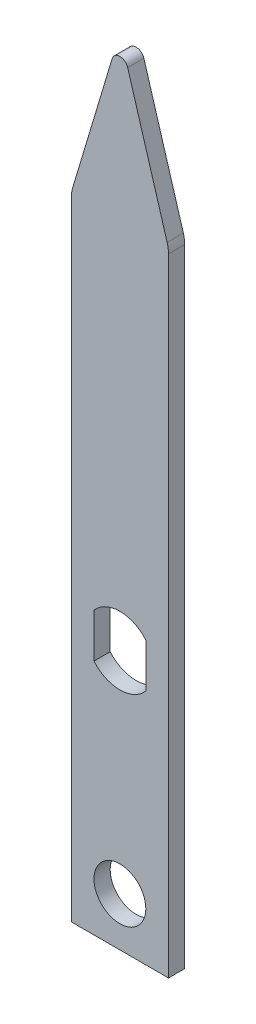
ISO-10303-21;
HEADER;
FILE_DESCRIPTION(('STEP AP214'),'2;1');
FILE_NAME('part.step','',(''),(''),'','','');
FILE_SCHEMA(('AUTOMOTIVE_DESIGN { 1 0 10303 214 1 1 1 1 }'));
ENDSEC;
DATA;
#1=APPLICATION_CONTEXT('core data for automotive mechanical design processes');
#2=APPLICATION_PROTOCOL_DEFINITION('international standard','automotive_design',2000,#1);
#3=PRODUCT_CONTEXT('',#1,'mechanical');
#4=PRODUCT('Part','Part','',(#3));
#5=PRODUCT_RELATED_PRODUCT_CATEGORY('part','',(#4));
#6=PRODUCT_DEFINITION_FORMATION('','',#4);
#7=PRODUCT_DEFINITION_CONTEXT('part definition',#1,'design');
#8=PRODUCT_DEFINITION('design','',#6,#7);
#9=PRODUCT_DEFINITION_SHAPE('','',#8);
#10=(LENGTH_UNIT() NAMED_UNIT(*) SI_UNIT(.MILLI.,.METRE.));
#11=(NAMED_UNIT(*) PLANE_ANGLE_UNIT() SI_UNIT($,.RADIAN.));
#12=(NAMED_UNIT(*) SI_UNIT($,.STERADIAN.) SOLID_ANGLE_UNIT());
#13=UNCERTAINTY_MEASURE_WITH_UNIT(LENGTH_MEASURE(1.E-05),#10,'distance_accuracy_value','');
#14=(GEOMETRIC_REPRESENTATION_CONTEXT(3) GLOBAL_UNCERTAINTY_ASSIGNED_CONTEXT((#13)) GLOBAL_UNIT_ASSIGNED_CONTEXT((#10,
#11,#12)) REPRESENTATION_CONTEXT('',''));
#15=CARTESIAN_POINT('',(0.,0.,0.));
#16=DIRECTION('',(0.,0.,1.));
#17=DIRECTION('',(1.,0.,0.));
#18=AXIS2_PLACEMENT_3D('',#15,#16,#17);
#19=CARTESIAN_POINT('',(15.,0.,5.));
#20=DIRECTION('',(0.,1.,0.));
#21=DIRECTION('',(-1.,0.,0.));
#22=AXIS2_PLACEMENT_3D('',#19,#20,#21);
#23=PLANE('',#22);
#24=DIRECTION('',(1.,0.,0.));
#25=VECTOR('',#24,1.);
#26=CARTESIAN_POINT('',(15.,0.,0.));
#27=LINE('',#26,#25);
#28=CARTESIAN_POINT('',(-15.,0.,0.));
#29=VERTEX_POINT('',#28);
#30=CARTESIAN_POINT('',(15.,0.,0.));
#31=VERTEX_POINT('',#30);
#32=EDGE_CURVE('E168',#29,#31,#27,.T.);
#33=ORIENTED_EDGE('',*,*,#32,.T.);
#34=DIRECTION('',(0.,0.,-1.));
#35=VECTOR('',#34,1.);
#36=CARTESIAN_POINT('',(15.,0.,5.));
#37=LINE('',#36,#35);
#38=CARTESIAN_POINT('',(15.,0.,5.));
#39=VERTEX_POINT('',#38);
#40=EDGE_CURVE('E197',#39,#31,#37,.T.);
#41=ORIENTED_EDGE('',*,*,#40,.F.);
#42=DIRECTION('',(1.,0.,0.));
#43=VECTOR('',#42,1.);
#44=CARTESIAN_POINT('',(15.,0.,5.));
#45=LINE('',#44,#43);
#46=CARTESIAN_POINT('',(-15.,0.,5.));
#47=VERTEX_POINT('',#46);
#48=EDGE_CURVE('E171',#47,#39,#45,.T.);
#49=ORIENTED_EDGE('',*,*,#48,.F.);
#50=DIRECTION('',(0.,0.,-1.));
#51=VECTOR('',#50,1.);
#52=CARTESIAN_POINT('',(-15.,0.,5.));
#53=LINE('',#52,#51);
#54=EDGE_CURVE('E184',#47,#29,#53,.T.);
#55=ORIENTED_EDGE('',*,*,#54,.T.);
#56=EDGE_LOOP('',(#33,#41,#49,#55));
#57=FACE_BOUND('',#56,.T.);
#58=ADVANCED_FACE('F33',(#57),#23,.F.);
#59=CARTESIAN_POINT('',(15.,195.,5.));
#60=DIRECTION('',(-1.,0.,0.));
#61=DIRECTION('',(0.,-1.,0.));
#62=AXIS2_PLACEMENT_3D('',#59,#60,#61);
#63=PLANE('',#62);
#64=DIRECTION('',(0.,1.,0.));
#65=VECTOR('',#64,1.);
#66=CARTESIAN_POINT('',(15.,195.,0.));
#67=LINE('',#66,#65);
#68=CARTESIAN_POINT('',(15.,193.532311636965,0.));
#69=VERTEX_POINT('',#68);
#70=EDGE_CURVE('E187',#31,#69,#67,.T.);
#71=ORIENTED_EDGE('',*,*,#70,.T.);
#72=DIRECTION('',(0.,0.,-1.));
#73=VECTOR('',#72,1.);
#74=CARTESIAN_POINT('',(15.,193.532311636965,5.));
#75=LINE('',#74,#73);
#76=CARTESIAN_POINT('',(15.,193.532311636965,5.));
#77=VERTEX_POINT('',#76);
#78=EDGE_CURVE('E218',#69,#77,#75,.F.);
#79=ORIENTED_EDGE('',*,*,#78,.T.);
#80=DIRECTION('',(0.,1.,0.));
#81=VECTOR('',#80,1.);
#82=CARTESIAN_POINT('',(15.,195.,5.));
#83=LINE('',#82,#81);
#84=EDGE_CURVE('E174',#39,#77,#83,.T.);
#85=ORIENTED_EDGE('',*,*,#84,.F.);
#86=ORIENTED_EDGE('',*,*,#40,.T.);
#87=EDGE_LOOP('',(#71,#79,#85,#86));
#88=FACE_BOUND('',#87,.T.);
#89=ADVANCED_FACE('F257',(#88),#63,.F.);
#90=CARTESIAN_POINT('',(0.,245.,5.));
#91=DIRECTION('',(-0.957826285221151,-0.287347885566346,0.));
#92=DIRECTION('',(0.287347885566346,-0.957826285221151,0.));
#93=AXIS2_PLACEMENT_3D('',#90,#91,#92);
#94=PLANE('',#93);
#95=DIRECTION('',(-0.287347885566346,0.957826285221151,0.));
#96=VECTOR('',#95,1.);
#97=CARTESIAN_POINT('',(0.,245.,5.));
#98=LINE('',#97,#96);
#99=CARTESIAN_POINT('',(14.5782628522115,196.405790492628,5.));
#100=VERTEX_POINT('',#99);
#101=CARTESIAN_POINT('',(2.39456571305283,237.018114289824,5.));
#102=VERTEX_POINT('',#101);
#103=EDGE_CURVE('E178',#100,#102,#98,.T.);
#104=ORIENTED_EDGE('',*,*,#103,.F.);
#105=DIRECTION('',(0.,0.,-1.));
#106=VECTOR('',#105,1.);
#107=CARTESIAN_POINT('',(14.5782628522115,196.405790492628,5.));
#108=LINE('',#107,#106);
#109=CARTESIAN_POINT('',(14.5782628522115,196.405790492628,0.));
#110=VERTEX_POINT('',#109);
#111=EDGE_CURVE('E211',#100,#110,#108,.T.);
#112=ORIENTED_EDGE('',*,*,#111,.T.);
#113=DIRECTION('',(-0.287347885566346,0.957826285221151,0.));
#114=VECTOR('',#113,1.);
#115=CARTESIAN_POINT('',(0.,245.,0.));
#116=LINE('',#115,#114);
#117=CARTESIAN_POINT('',(2.39456571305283,237.018114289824,0.));
#118=VERTEX_POINT('',#117);
#119=EDGE_CURVE('E190',#110,#118,#116,.T.);
#120=ORIENTED_EDGE('',*,*,#119,.T.);
#121=DIRECTION('',(0.,0.,-1.));
#122=VECTOR('',#121,1.);
#123=CARTESIAN_POINT('',(2.39456571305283,237.018114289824,5.));
#124=LINE('',#123,#122);
#125=EDGE_CURVE('E206',#118,#102,#124,.F.);
#126=ORIENTED_EDGE('',*,*,#125,.T.);
#127=EDGE_LOOP('',(#104,#112,#120,#126));
#128=FACE_BOUND('',#127,.T.);
#129=ADVANCED_FACE('F245',(#128),#94,.F.);
#130=CARTESIAN_POINT('',(-15.0000000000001,195.,5.));
#131=DIRECTION('',(0.957826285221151,-0.287347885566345,0.));
#132=DIRECTION('',(0.287347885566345,0.957826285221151,0.));
#133=AXIS2_PLACEMENT_3D('',#130,#131,#132);
#134=PLANE('',#133);
#135=DIRECTION('',(-0.287347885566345,-0.957826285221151,0.));
#136=VECTOR('',#135,1.);
#137=CARTESIAN_POINT('',(-15.0000000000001,195.,0.));
#138=LINE('',#137,#136);
#139=CARTESIAN_POINT('',(-2.39456571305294,237.018114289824,0.));
#140=VERTEX_POINT('',#139);
#141=CARTESIAN_POINT('',(-14.5782628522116,196.405790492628,0.));
#142=VERTEX_POINT('',#141);
#143=EDGE_CURVE('E192',#140,#142,#138,.T.);
#144=ORIENTED_EDGE('',*,*,#143,.T.);
#145=DIRECTION('',(0.,0.,-1.));
#146=VECTOR('',#145,1.);
#147=CARTESIAN_POINT('',(-14.5782628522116,196.405790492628,5.));
#148=LINE('',#147,#146);
#149=CARTESIAN_POINT('',(-14.5782628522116,196.405790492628,5.));
#150=VERTEX_POINT('',#149);
#151=EDGE_CURVE('E11',#142,#150,#148,.F.);
#152=ORIENTED_EDGE('',*,*,#151,.T.);
#153=DIRECTION('',(-0.287347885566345,-0.957826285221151,0.));
#154=VECTOR('',#153,1.);
#155=CARTESIAN_POINT('',(-15.0000000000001,195.,5.));
#156=LINE('',#155,#154);
#157=CARTESIAN_POINT('',(-2.39456571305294,237.018114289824,5.));
#158=VERTEX_POINT('',#157);
#159=EDGE_CURVE('E180',#158,#150,#156,.T.);
#160=ORIENTED_EDGE('',*,*,#159,.F.);
#161=DIRECTION('',(0.,0.,-1.));
#162=VECTOR('',#161,1.);
#163=CARTESIAN_POINT('',(-2.39456571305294,237.018114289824,5.));
#164=LINE('',#163,#162);
#165=EDGE_CURVE('E200',#158,#140,#164,.T.);
#166=ORIENTED_EDGE('',*,*,#165,.T.);
#167=EDGE_LOOP('',(#144,#152,#160,#166));
#168=FACE_BOUND('',#167,.T.);
#169=ADVANCED_FACE('F251',(#168),#134,.F.);
#170=CARTESIAN_POINT('',(-15.,0.,5.));
#171=DIRECTION('',(1.,0.,0.));
#172=DIRECTION('',(0.,1.,0.));
#173=AXIS2_PLACEMENT_3D('',#170,#171,#172);
#174=PLANE('',#173);
#175=DIRECTION('',(0.,-1.,0.));
#176=VECTOR('',#175,1.);
#177=CARTESIAN_POINT('',(-15.,0.,5.));
#178=LINE('',#177,#176);
#179=CARTESIAN_POINT('',(-15.0000000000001,193.532311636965,5.));
#180=VERTEX_POINT('',#179);
#181=EDGE_CURVE('E182',#180,#47,#178,.T.);
#182=ORIENTED_EDGE('',*,*,#181,.F.);
#183=DIRECTION('',(0.,0.,-1.));
#184=VECTOR('',#183,1.);
#185=CARTESIAN_POINT('',(-15.0000000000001,193.532311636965,5.));
#186=LINE('',#185,#184);
#187=CARTESIAN_POINT('',(-15.0000000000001,193.532311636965,0.));
#188=VERTEX_POINT('',#187);
#189=EDGE_CURVE('E41',#180,#188,#186,.T.);
#190=ORIENTED_EDGE('',*,*,#189,.T.);
#191=DIRECTION('',(0.,-1.,0.));
#192=VECTOR('',#191,1.);
#193=CARTESIAN_POINT('',(-15.,0.,0.));
#194=LINE('',#193,#192);
#195=EDGE_CURVE('E175',#188,#29,#194,.T.);
#196=ORIENTED_EDGE('',*,*,#195,.T.);
#197=ORIENTED_EDGE('',*,*,#54,.F.);
#198=EDGE_LOOP('',(#182,#190,#196,#197));
#199=FACE_BOUND('',#198,.T.);
#200=ADVANCED_FACE('F226',(#199),#174,.F.);
#201=CARTESIAN_POINT('',(-15.,0.,5.));
#202=DIRECTION('',(0.,0.,-1.));
#203=DIRECTION('',(-1.,0.,0.));
#204=AXIS2_PLACEMENT_3D('',#201,#202,#203);
#205=PLANE('',#204);
#206=DIRECTION('',(0.,1.,0.));
#207=VECTOR('',#206,1.);
#208=CARTESIAN_POINT('',(8.,86.8007352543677,5.));
#209=LINE('',#208,#207);
#210=CARTESIAN_POINT('',(8.,73.1992647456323,5.));
#211=VERTEX_POINT('',#210);
#212=CARTESIAN_POINT('',(8.,86.8007352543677,5.));
#213=VERTEX_POINT('',#212);
#214=EDGE_CURVE('E149',#211,#213,#209,.T.);
#215=ORIENTED_EDGE('',*,*,#214,.F.);
#216=CARTESIAN_POINT('',(0.,80.,5.));
#217=DIRECTION('',(0.,0.,1.));
#218=DIRECTION('',(1.,0.,0.));
#219=AXIS2_PLACEMENT_3D('',#216,#217,#218);
#220=CIRCLE('',#219,10.5);
#221=CARTESIAN_POINT('',(-8.,73.1992647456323,5.));
#222=VERTEX_POINT('',#221);
#223=EDGE_CURVE('E141',#222,#211,#220,.T.);
#224=ORIENTED_EDGE('',*,*,#223,.F.);
#225=DIRECTION('',(0.,-1.,0.));
#226=VECTOR('',#225,1.);
#227=CARTESIAN_POINT('',(-8.,86.8007352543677,5.));
#228=LINE('',#227,#226);
#229=CARTESIAN_POINT('',(-8.,86.8007352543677,5.));
#230=VERTEX_POINT('',#229);
#231=EDGE_CURVE('E142',#230,#222,#228,.T.);
#232=ORIENTED_EDGE('',*,*,#231,.F.);
#233=CARTESIAN_POINT('',(0.,80.,5.));
#234=DIRECTION('',(0.,0.,1.));
#235=DIRECTION('',(1.,0.,0.));
#236=AXIS2_PLACEMENT_3D('',#233,#234,#235);
#237=CIRCLE('',#236,10.5);
#238=EDGE_CURVE('E156',#213,#230,#237,.T.);
#239=ORIENTED_EDGE('',*,*,#238,.F.);
#240=EDGE_LOOP('',(#215,#224,#232,#239));
#241=FACE_BOUND('',#240,.T.);
#242=CARTESIAN_POINT('',(0.,15.,5.));
#243=DIRECTION('',(0.,0.,1.));
#244=DIRECTION('',(1.,0.,0.));
#245=AXIS2_PLACEMENT_3D('',#242,#243,#244);
#246=CIRCLE('',#245,8.);
#247=CARTESIAN_POINT('',(8.,15.,5.));
#248=VERTEX_POINT('',#247);
#249=EDGE_CURVE('E165',#248,#248,#246,.T.);
#250=ORIENTED_EDGE('',*,*,#249,.F.);
#251=EDGE_LOOP('',(#250));
#252=FACE_BOUND('',#251,.T.);
#253=ORIENTED_EDGE('',*,*,#84,.T.);
#254=CARTESIAN_POINT('',(4.99999999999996,193.532311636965,5.));
#255=DIRECTION('',(0.,0.,-1.));
#256=DIRECTION('',(-1.,0.,0.));
#257=AXIS2_PLACEMENT_3D('',#254,#255,#256);
#258=CIRCLE('',#257,10.);
#259=EDGE_CURVE('E221',#77,#100,#258,.F.);
#260=ORIENTED_EDGE('',*,*,#259,.T.);
#261=ORIENTED_EDGE('',*,*,#103,.T.);
#262=CARTESIAN_POINT('',(0.,236.299744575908,5.));
#263=DIRECTION('',(0.,0.,-1.));
#264=DIRECTION('',(-1.,0.,0.));
#265=AXIS2_PLACEMENT_3D('',#262,#263,#264);
#266=CIRCLE('',#265,2.5);
#267=EDGE_CURVE('E209',#102,#158,#266,.F.);
#268=ORIENTED_EDGE('',*,*,#267,.T.);
#269=ORIENTED_EDGE('',*,*,#159,.T.);
#270=CARTESIAN_POINT('',(-5.00000000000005,193.532311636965,5.));
#271=DIRECTION('',(0.,0.,-1.));
#272=DIRECTION('',(-1.,0.,0.));
#273=AXIS2_PLACEMENT_3D('',#270,#271,#272);
#274=CIRCLE('',#273,10.);
#275=EDGE_CURVE('E48',#150,#180,#274,.F.);
#276=ORIENTED_EDGE('',*,*,#275,.T.);
#277=ORIENTED_EDGE('',*,*,#181,.T.);
#278=ORIENTED_EDGE('',*,*,#48,.T.);
#279=EDGE_LOOP('',(#253,#260,#261,#268,#269,#276,#277,#278));
#280=FACE_BOUND('',#279,.T.);
#281=ADVANCED_FACE('F236',(#241,#252,#280),#205,.F.);
#282=CARTESIAN_POINT('',(-15.,0.,0.));
#283=DIRECTION('',(0.,0.,-1.));
#284=DIRECTION('',(-1.,0.,0.));
#285=AXIS2_PLACEMENT_3D('',#282,#283,#284);
#286=PLANE('',#285);
#287=CARTESIAN_POINT('',(0.,80.,0.));
#288=DIRECTION('',(0.,0.,-1.));
#289=DIRECTION('',(-1.,0.,0.));
#290=AXIS2_PLACEMENT_3D('',#287,#288,#289);
#291=CIRCLE('',#290,10.5);
#292=CARTESIAN_POINT('',(-8.,73.1992647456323,0.));
#293=VERTEX_POINT('',#292);
#294=CARTESIAN_POINT('',(8.,73.1992647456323,0.));
#295=VERTEX_POINT('',#294);
#296=EDGE_CURVE('E138',#293,#295,#291,.F.);
#297=ORIENTED_EDGE('',*,*,#296,.T.);
#298=DIRECTION('',(0.,1.,0.));
#299=VECTOR('',#298,1.);
#300=CARTESIAN_POINT('',(8.,86.8007352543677,0.));
#301=LINE('',#300,#299);
#302=CARTESIAN_POINT('',(8.,86.8007352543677,0.));
#303=VERTEX_POINT('',#302);
#304=EDGE_CURVE('E122',#295,#303,#301,.T.);
#305=ORIENTED_EDGE('',*,*,#304,.T.);
#306=CARTESIAN_POINT('',(0.,80.,0.));
#307=DIRECTION('',(0.,0.,-1.));
#308=DIRECTION('',(-1.,0.,0.));
#309=AXIS2_PLACEMENT_3D('',#306,#307,#308);
#310=CIRCLE('',#309,10.5);
#311=CARTESIAN_POINT('',(-8.,86.8007352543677,0.));
#312=VERTEX_POINT('',#311);
#313=EDGE_CURVE('E151',#303,#312,#310,.F.);
#314=ORIENTED_EDGE('',*,*,#313,.T.);
#315=DIRECTION('',(0.,-1.,0.));
#316=VECTOR('',#315,1.);
#317=CARTESIAN_POINT('',(-8.,86.8007352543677,0.));
#318=LINE('',#317,#316);
#319=EDGE_CURVE('E147',#312,#293,#318,.T.);
#320=ORIENTED_EDGE('',*,*,#319,.T.);
#321=EDGE_LOOP('',(#297,#305,#314,#320));
#322=FACE_BOUND('',#321,.T.);
#323=CARTESIAN_POINT('',(0.,15.,0.));
#324=DIRECTION('',(0.,0.,-1.));
#325=DIRECTION('',(-1.,0.,0.));
#326=AXIS2_PLACEMENT_3D('',#323,#324,#325);
#327=CIRCLE('',#326,8.);
#328=CARTESIAN_POINT('',(-8.,15.,0.));
#329=VERTEX_POINT('',#328);
#330=EDGE_CURVE('E133',#329,#329,#327,.F.);
#331=ORIENTED_EDGE('',*,*,#330,.T.);
#332=EDGE_LOOP('',(#331));
#333=FACE_BOUND('',#332,.T.);
#334=ORIENTED_EDGE('',*,*,#119,.F.);
#335=CARTESIAN_POINT('',(4.99999999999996,193.532311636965,0.));
#336=DIRECTION('',(0.,0.,-1.));
#337=DIRECTION('',(-1.,0.,0.));
#338=AXIS2_PLACEMENT_3D('',#335,#336,#337);
#339=CIRCLE('',#338,10.);
#340=EDGE_CURVE('E216',#110,#69,#339,.T.);
#341=ORIENTED_EDGE('',*,*,#340,.T.);
#342=ORIENTED_EDGE('',*,*,#70,.F.);
#343=ORIENTED_EDGE('',*,*,#32,.F.);
#344=ORIENTED_EDGE('',*,*,#195,.F.);
#345=CARTESIAN_POINT('',(-5.00000000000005,193.532311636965,0.));
#346=DIRECTION('',(0.,0.,-1.));
#347=DIRECTION('',(-1.,0.,0.));
#348=AXIS2_PLACEMENT_3D('',#345,#346,#347);
#349=CIRCLE('',#348,10.);
#350=EDGE_CURVE('E214',#188,#142,#349,.T.);
#351=ORIENTED_EDGE('',*,*,#350,.T.);
#352=ORIENTED_EDGE('',*,*,#143,.F.);
#353=CARTESIAN_POINT('',(0.,236.299744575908,0.));
#354=DIRECTION('',(0.,0.,-1.));
#355=DIRECTION('',(-1.,0.,0.));
#356=AXIS2_PLACEMENT_3D('',#353,#354,#355);
#357=CIRCLE('',#356,2.5);
#358=EDGE_CURVE('E203',#140,#118,#357,.T.);
#359=ORIENTED_EDGE('',*,*,#358,.T.);
#360=EDGE_LOOP('',(#334,#341,#342,#343,#344,#351,#352,#359));
#361=FACE_BOUND('',#360,.T.);
#362=ADVANCED_FACE('F145',(#322,#333,#361),#286,.T.);
#363=CARTESIAN_POINT('',(0.,15.,-0.00100000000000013));
#364=DIRECTION('',(0.,0.,1.));
#365=DIRECTION('',(1.,0.,0.));
#366=AXIS2_PLACEMENT_3D('',#363,#364,#365);
#367=CYLINDRICAL_SURFACE('',#366,8.);
#368=ORIENTED_EDGE('',*,*,#330,.F.);
#369=EDGE_LOOP('',(#368));
#370=FACE_BOUND('',#369,.T.);
#371=ORIENTED_EDGE('',*,*,#249,.T.);
#372=EDGE_LOOP('',(#371));
#373=FACE_BOUND('',#372,.T.);
#374=ADVANCED_FACE('F281',(#370,#373),#367,.F.);
#375=CARTESIAN_POINT('',(0.,80.,-0.00100000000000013));
#376=DIRECTION('',(0.,0.,1.));
#377=DIRECTION('',(1.,0.,0.));
#378=AXIS2_PLACEMENT_3D('',#375,#376,#377);
#379=CYLINDRICAL_SURFACE('',#378,10.5);
#380=DIRECTION('',(0.,0.,1.));
#381=VECTOR('',#380,1.);
#382=CARTESIAN_POINT('',(-8.,73.1992647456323,-0.00100000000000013));
#383=LINE('',#382,#381);
#384=EDGE_CURVE('E134',#293,#222,#383,.T.);
#385=ORIENTED_EDGE('',*,*,#384,.T.);
#386=ORIENTED_EDGE('',*,*,#223,.T.);
#387=DIRECTION('',(0.,0.,1.));
#388=VECTOR('',#387,1.);
#389=CARTESIAN_POINT('',(8.,73.1992647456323,-0.00100000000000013));
#390=LINE('',#389,#388);
#391=EDGE_CURVE('E126',#295,#211,#390,.T.);
#392=ORIENTED_EDGE('',*,*,#391,.F.);
#393=ORIENTED_EDGE('',*,*,#296,.F.);
#394=EDGE_LOOP('',(#385,#386,#392,#393));
#395=FACE_BOUND('',#394,.T.);
#396=ADVANCED_FACE('F137',(#395),#379,.F.);
#397=CARTESIAN_POINT('',(-8.,86.8007352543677,-0.00100000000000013));
#398=DIRECTION('',(-1.,0.,0.));
#399=DIRECTION('',(0.,0.,1.));
#400=AXIS2_PLACEMENT_3D('',#397,#398,#399);
#401=PLANE('',#400);
#402=DIRECTION('',(0.,0.,1.));
#403=VECTOR('',#402,1.);
#404=CARTESIAN_POINT('',(-8.,86.8007352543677,-0.00100000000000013));
#405=LINE('',#404,#403);
#406=EDGE_CURVE('E162',#312,#230,#405,.T.);
#407=ORIENTED_EDGE('',*,*,#406,.T.);
#408=ORIENTED_EDGE('',*,*,#231,.T.);
#409=ORIENTED_EDGE('',*,*,#384,.F.);
#410=ORIENTED_EDGE('',*,*,#319,.F.);
#411=EDGE_LOOP('',(#407,#408,#409,#410));
#412=FACE_BOUND('',#411,.T.);
#413=ADVANCED_FACE('F274',(#412),#401,.F.);
#414=CARTESIAN_POINT('',(0.,80.,-0.00100000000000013));
#415=DIRECTION('',(0.,0.,1.));
#416=DIRECTION('',(1.,0.,0.));
#417=AXIS2_PLACEMENT_3D('',#414,#415,#416);
#418=CYLINDRICAL_SURFACE('',#417,10.5);
#419=DIRECTION('',(0.,0.,1.));
#420=VECTOR('',#419,1.);
#421=CARTESIAN_POINT('',(8.,86.8007352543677,-0.00100000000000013));
#422=LINE('',#421,#420);
#423=EDGE_CURVE('E128',#303,#213,#422,.T.);
#424=ORIENTED_EDGE('',*,*,#423,.T.);
#425=ORIENTED_EDGE('',*,*,#238,.T.);
#426=ORIENTED_EDGE('',*,*,#406,.F.);
#427=ORIENTED_EDGE('',*,*,#313,.F.);
#428=EDGE_LOOP('',(#424,#425,#426,#427));
#429=FACE_BOUND('',#428,.T.);
#430=ADVANCED_FACE('F269',(#429),#418,.F.);
#431=CARTESIAN_POINT('',(8.,86.8007352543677,-0.00100000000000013));
#432=DIRECTION('',(1.,0.,0.));
#433=DIRECTION('',(0.,0.,-1.));
#434=AXIS2_PLACEMENT_3D('',#431,#432,#433);
#435=PLANE('',#434);
#436=ORIENTED_EDGE('',*,*,#391,.T.);
#437=ORIENTED_EDGE('',*,*,#214,.T.);
#438=ORIENTED_EDGE('',*,*,#423,.F.);
#439=ORIENTED_EDGE('',*,*,#304,.F.);
#440=EDGE_LOOP('',(#436,#437,#438,#439));
#441=FACE_BOUND('',#440,.T.);
#442=ADVANCED_FACE('F124',(#441),#435,.F.);
#443=CARTESIAN_POINT('',(0.,236.299744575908,5.));
#444=DIRECTION('',(0.,0.,-1.));
#445=DIRECTION('',(-1.,0.,0.));
#446=AXIS2_PLACEMENT_3D('',#443,#444,#445);
#447=CYLINDRICAL_SURFACE('',#446,2.5);
#448=ORIENTED_EDGE('',*,*,#267,.F.);
#449=ORIENTED_EDGE('',*,*,#125,.F.);
#450=ORIENTED_EDGE('',*,*,#358,.F.);
#451=ORIENTED_EDGE('',*,*,#165,.F.);
#452=EDGE_LOOP('',(#448,#449,#450,#451));
#453=FACE_BOUND('',#452,.T.);
#454=ADVANCED_FACE('F250',(#453),#447,.T.);
#455=CARTESIAN_POINT('',(4.99999999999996,193.532311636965,5.));
#456=DIRECTION('',(0.,0.,-1.));
#457=DIRECTION('',(-1.,0.,0.));
#458=AXIS2_PLACEMENT_3D('',#455,#456,#457);
#459=CYLINDRICAL_SURFACE('',#458,10.);
#460=ORIENTED_EDGE('',*,*,#259,.F.);
#461=ORIENTED_EDGE('',*,*,#78,.F.);
#462=ORIENTED_EDGE('',*,*,#340,.F.);
#463=ORIENTED_EDGE('',*,*,#111,.F.);
#464=EDGE_LOOP('',(#460,#461,#462,#463));
#465=FACE_BOUND('',#464,.T.);
#466=ADVANCED_FACE('F243',(#465),#459,.T.);
#467=CARTESIAN_POINT('',(-5.00000000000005,193.532311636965,5.));
#468=DIRECTION('',(0.,0.,-1.));
#469=DIRECTION('',(-1.,0.,0.));
#470=AXIS2_PLACEMENT_3D('',#467,#468,#469);
#471=CYLINDRICAL_SURFACE('',#470,10.);
#472=ORIENTED_EDGE('',*,*,#275,.F.);
#473=ORIENTED_EDGE('',*,*,#151,.F.);
#474=ORIENTED_EDGE('',*,*,#350,.F.);
#475=ORIENTED_EDGE('',*,*,#189,.F.);
#476=EDGE_LOOP('',(#472,#473,#474,#475));
#477=FACE_BOUND('',#476,.T.);
#478=ADVANCED_FACE('F35',(#477),#471,.T.);
#479=CLOSED_SHELL('',(#58,#89,#129,#169,#200,#281,#362,#374,#396,#413,#430,#442,#454,#466,#478));
#480=MANIFOLD_SOLID_BREP('B2',#479);
#481=ADVANCED_BREP_SHAPE_REPRESENTATION('',(#18,#480),#14);
#482=SHAPE_DEFINITION_REPRESENTATION(#9,#481);
ENDSEC;
END-ISO-10303-21;
